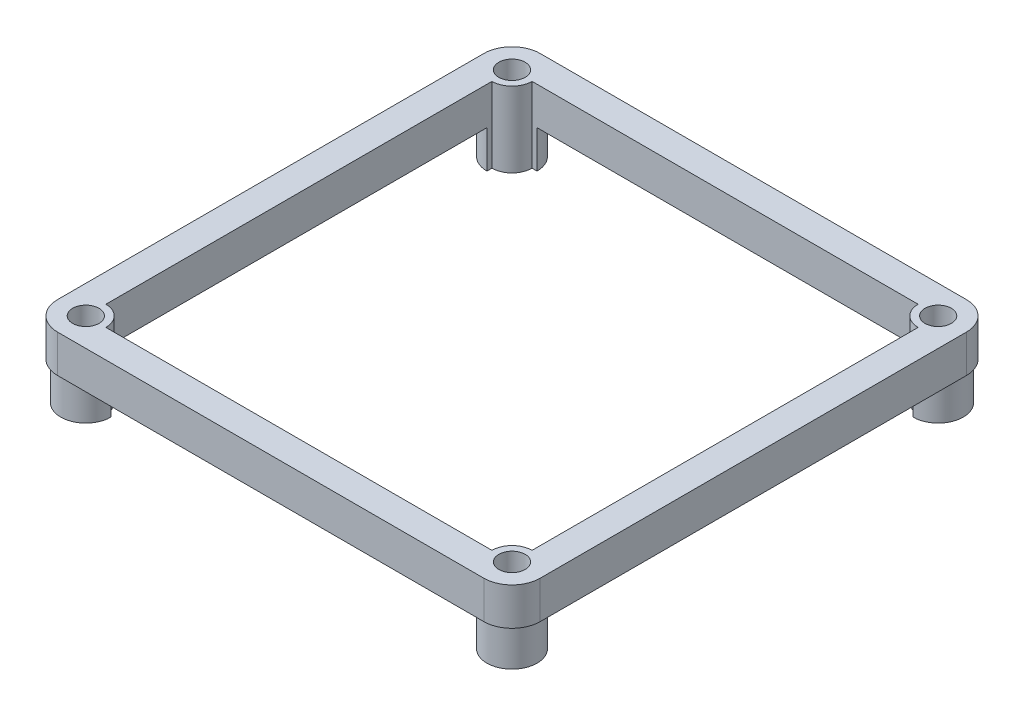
from build123d import *

# Parameters (mm, degrees)
SKETCH1_R             = 1.05
BOSS_EXTRUDE1_DEPTH   = 6
BOSS_EXTRUDE1_2_DEPTH = 6
BOSS_EXTRUDE1_3_DEPTH = 6
BOSS_EXTRUDE1_4_DEPTH = 6
BOSS_EXTRUDE2_START   = -3
BOSS_EXTRUDE2_DEPTH   = 3


with BuildPart() as part:
    # Sketch1 → Boss-Extrude1 (new body)
    with BuildSketch(Plane(origin=(0, 0, 0), x_dir=(1, 0, 0), z_dir=(0, 1, 0))):
        with BuildLine():
            Line((0, 32), (0, 32.4))
            ThreePointArc((0, 32.4), (1.13137085, 32.86862915), (1.6, 34))
            Line((1.6, 34), (2, 34))
            ThreePointArc((2, 34), (-1.414213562, 35.414213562), (0, 32))
        make_face()
        with Locations(Location((0, 34, 0), (0, 0, 270))):
            Circle(SKETCH1_R, mode=Mode.SUBTRACT)
    extrude(amount=BOSS_EXTRUDE1_DEPTH)



with BuildPart() as body_2:
    # Sketch1 → Boss-Extrude1 2 (new body)
    with BuildSketch(Plane(origin=(0, 0, 0), x_dir=(1, 0, 0), z_dir=(0, 1, 0))):
        with BuildLine():
            Line((32, 34), (32.4, 34))
            ThreePointArc((32.4, 34), (32.86862915, 32.86862915), (34, 32.4))
            Line((34, 32.4), (34, 32))
            ThreePointArc((34, 32), (35.414213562, 35.414213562), (32, 34))
        make_face()
        with Locations(Location((34, 34, 0), (0, 0, 270))):
            Circle(SKETCH1_R, mode=Mode.SUBTRACT)
    extrude(amount=BOSS_EXTRUDE1_2_DEPTH)


with BuildPart() as body_3:
    # Sketch1 → Boss-Extrude1 3 (new body)
    with BuildSketch(Plane(origin=(0, 0, 0), x_dir=(1, 0, 0), z_dir=(0, 1, 0))):
        with BuildLine():
            Line((32, 0), (32.4, 0))
            ThreePointArc((32.4, 0), (32.86862915, 1.13137085), (34, 1.6))
            Line((34, 1.6), (34, 2))
            ThreePointArc((34, 2), (35.414213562, -1.414213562), (32, 0))
        make_face()
        with Locations(Location((34, 0, 0), (0, 0, 270))):
            Circle(SKETCH1_R, mode=Mode.SUBTRACT)
    extrude(amount=BOSS_EXTRUDE1_3_DEPTH)


with BuildPart() as body_4:
    # Sketch1 → Boss-Extrude1 4 (new body)
    with BuildSketch(Plane(origin=(0, 0, 0), x_dir=(1, 0, 0), z_dir=(0, 1, 0))):
        with BuildLine():
            Line((0, 2), (0, 1.6))
            ThreePointArc((0, 1.6), (1.13137085, 1.13137085), (1.6, 0))
            Line((1.6, 0), (2, 0))
            ThreePointArc((2, 0), (-1.414213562, -1.414213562), (0, 2))
        make_face()
        with Locations(Location((0, 0, 0), (0, 0, 270))):
            Circle(SKETCH1_R, mode=Mode.SUBTRACT)
    extrude(amount=BOSS_EXTRUDE1_4_DEPTH)


with BuildPart() as part_1:
    add(part.part)

    add(body_2.part)  # Boss-Extrude2 merges body 2

    add(body_3.part)  # Boss-Extrude2 merges body 3

    add(body_4.part)  # Boss-Extrude2 merges body 4
    # Sketch4 → Boss-Extrude2 (add)
    with BuildSketch(Plane(origin=(0, 6, 0), x_dir=(1, 0, 0), z_dir=(0, 1, 0)).offset(BOSS_EXTRUDE2_START)):
        with BuildLine():
            Line((-2.25, 0), (-2.25, 34))
            ThreePointArc((-2.25, 34), (-1.590990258, 35.590990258), (0, 36.25))
            Line((0, 36.25), (34, 36.25))
            ThreePointArc((34, 36.25), (35.590990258, 35.590990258), (36.25, 34))
            Line((36.25, 34), (36.25, 0))
            ThreePointArc((36.25, 0), (35.590990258, -1.590990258), (34, -2.25))
            Line((34, -2.25), (0, -2.25))
            ThreePointArc((0, -2.25), (-1.590990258, -1.590990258), (-2.25, 0))
        make_face()
        with BuildLine():
            Line((34, 1.6), (34, 32.4))
            ThreePointArc((34, 32.4), (35.13137085, 35.13137085), (32.4, 34))
            Line((32.4, 34), (1.6, 34))
            ThreePointArc((1.6, 34), (-1.13137085, 35.13137085), (0, 32.4))
            Line((0, 32.4), (0, 1.6))
            ThreePointArc((0, 1.6), (-1.13137085, -1.13137085), (1.6, 0))
            Line((1.6, 0), (32.4, 0))
            ThreePointArc((32.4, 0), (35.13137085, -1.13137085), (34, 1.6))
        make_face(mode=Mode.SUBTRACT)
    extrude(amount=BOSS_EXTRUDE2_DEPTH)


solid = part_1.part
